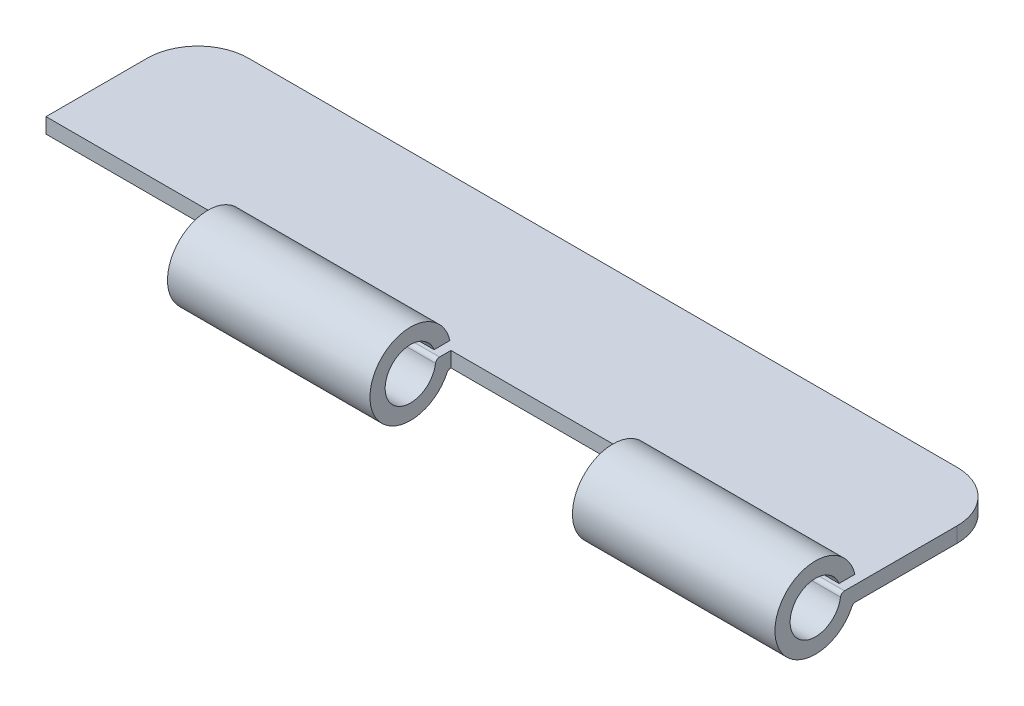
ISO-10303-21;
HEADER;
FILE_DESCRIPTION(('STEP AP214'),'2;1');
FILE_NAME('part.step','',(''),(''),'','','');
FILE_SCHEMA(('AUTOMOTIVE_DESIGN { 1 0 10303 214 1 1 1 1 }'));
ENDSEC;
DATA;
#1=APPLICATION_CONTEXT('core data for automotive mechanical design processes');
#2=APPLICATION_PROTOCOL_DEFINITION('international standard','automotive_design',2000,#1);
#3=PRODUCT_CONTEXT('',#1,'mechanical');
#4=PRODUCT('Part','Part','',(#3));
#5=PRODUCT_RELATED_PRODUCT_CATEGORY('part','',(#4));
#6=PRODUCT_DEFINITION_FORMATION('','',#4);
#7=PRODUCT_DEFINITION_CONTEXT('part definition',#1,'design');
#8=PRODUCT_DEFINITION('design','',#6,#7);
#9=PRODUCT_DEFINITION_SHAPE('','',#8);
#10=(LENGTH_UNIT() NAMED_UNIT(*) SI_UNIT(.MILLI.,.METRE.));
#11=(NAMED_UNIT(*) PLANE_ANGLE_UNIT() SI_UNIT($,.RADIAN.));
#12=(NAMED_UNIT(*) SI_UNIT($,.STERADIAN.) SOLID_ANGLE_UNIT());
#13=UNCERTAINTY_MEASURE_WITH_UNIT(LENGTH_MEASURE(1.E-05),#10,'distance_accuracy_value','');
#14=(GEOMETRIC_REPRESENTATION_CONTEXT(3) GLOBAL_UNCERTAINTY_ASSIGNED_CONTEXT((#13)) GLOBAL_UNIT_ASSIGNED_CONTEXT((#10,
#11,#12)) REPRESENTATION_CONTEXT('',''));
#15=CARTESIAN_POINT('',(0.,0.,0.));
#16=DIRECTION('',(0.,0.,1.));
#17=DIRECTION('',(1.,0.,0.));
#18=AXIS2_PLACEMENT_3D('',#15,#16,#17);
#19=CARTESIAN_POINT('',(-40.,1.5,17.5));
#20=DIRECTION('',(0.,0.,-1.));
#21=DIRECTION('',(-1.,0.,0.));
#22=AXIS2_PLACEMENT_3D('',#19,#20,#21);
#23=PLANE('',#22);
#24=DIRECTION('',(0.,1.,0.));
#25=VECTOR('',#24,1.);
#26=CARTESIAN_POINT('',(-20.,0.,17.5));
#27=LINE('',#26,#25);
#28=CARTESIAN_POINT('',(-20.,0.,17.5));
#29=VERTEX_POINT('',#28);
#30=CARTESIAN_POINT('',(-20.,1.5,17.5));
#31=VERTEX_POINT('',#30);
#32=EDGE_CURVE('E57',#29,#31,#27,.T.);
#33=ORIENTED_EDGE('',*,*,#32,.T.);
#34=DIRECTION('',(1.,0.,0.));
#35=VECTOR('',#34,1.);
#36=CARTESIAN_POINT('',(-40.,1.5,17.5));
#37=LINE('',#36,#35);
#38=CARTESIAN_POINT('',(-40.,1.5,17.5));
#39=VERTEX_POINT('',#38);
#40=EDGE_CURVE('E298',#39,#31,#37,.T.);
#41=ORIENTED_EDGE('',*,*,#40,.F.);
#42=DIRECTION('',(0.,-1.,0.));
#43=VECTOR('',#42,1.);
#44=CARTESIAN_POINT('',(-40.,1.5,17.5));
#45=LINE('',#44,#43);
#46=CARTESIAN_POINT('',(-40.,0.,17.5));
#47=VERTEX_POINT('',#46);
#48=EDGE_CURVE('E11',#39,#47,#45,.T.);
#49=ORIENTED_EDGE('',*,*,#48,.T.);
#50=DIRECTION('',(1.,0.,0.));
#51=VECTOR('',#50,1.);
#52=CARTESIAN_POINT('',(-40.,0.,17.5));
#53=LINE('',#52,#51);
#54=EDGE_CURVE('E312',#47,#29,#53,.T.);
#55=ORIENTED_EDGE('',*,*,#54,.T.);
#56=EDGE_LOOP('',(#33,#41,#49,#55));
#57=FACE_BOUND('',#56,.T.);
#58=ADVANCED_FACE('F34',(#57),#23,.F.);
#59=CARTESIAN_POINT('',(-40.,1.5,17.5));
#60=DIRECTION('',(1.,0.,0.));
#61=DIRECTION('',(0.,0.,-1.));
#62=AXIS2_PLACEMENT_3D('',#59,#60,#61);
#63=PLANE('',#62);
#64=DIRECTION('',(0.,0.,1.));
#65=VECTOR('',#64,1.);
#66=CARTESIAN_POINT('',(-40.,0.,17.5));
#67=LINE('',#66,#65);
#68=CARTESIAN_POINT('',(-40.,0.,7.50000000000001));
#69=VERTEX_POINT('',#68);
#70=EDGE_CURVE('E282',#69,#47,#67,.T.);
#71=ORIENTED_EDGE('',*,*,#70,.T.);
#72=ORIENTED_EDGE('',*,*,#48,.F.);
#73=DIRECTION('',(0.,0.,1.));
#74=VECTOR('',#73,1.);
#75=CARTESIAN_POINT('',(-40.,1.5,17.5));
#76=LINE('',#75,#74);
#77=CARTESIAN_POINT('',(-40.,1.5,7.50000000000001));
#78=VERTEX_POINT('',#77);
#79=EDGE_CURVE('E294',#78,#39,#76,.T.);
#80=ORIENTED_EDGE('',*,*,#79,.F.);
#81=DIRECTION('',(0.,-1.,0.));
#82=VECTOR('',#81,1.);
#83=CARTESIAN_POINT('',(-40.,1.5,7.50000000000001));
#84=LINE('',#83,#82);
#85=EDGE_CURVE('E308',#78,#69,#84,.T.);
#86=ORIENTED_EDGE('',*,*,#85,.T.);
#87=EDGE_LOOP('',(#71,#72,#80,#86));
#88=FACE_BOUND('',#87,.T.);
#89=ADVANCED_FACE('F36',(#88),#63,.F.);
#90=CARTESIAN_POINT('',(0.,1.5,17.5));
#91=VERTEX_POINT('',#90);
#92=CARTESIAN_POINT('',(20.,1.5,17.5));
#93=VERTEX_POINT('',#92);
#94=EDGE_CURVE('E49',#91,#93,#37,.T.);
#95=ORIENTED_EDGE('',*,*,#94,.F.);
#96=DIRECTION('',(0.,1.,0.));
#97=VECTOR('',#96,1.);
#98=CARTESIAN_POINT('',(0.,0.,17.5));
#99=LINE('',#98,#97);
#100=CARTESIAN_POINT('',(0.,0.,17.5));
#101=VERTEX_POINT('',#100);
#102=EDGE_CURVE('E219',#101,#91,#99,.T.);
#103=ORIENTED_EDGE('',*,*,#102,.F.);
#104=CARTESIAN_POINT('',(20.,0.,17.5));
#105=VERTEX_POINT('',#104);
#106=EDGE_CURVE('E311',#101,#105,#53,.T.);
#107=ORIENTED_EDGE('',*,*,#106,.T.);
#108=DIRECTION('',(0.,1.,0.));
#109=VECTOR('',#108,1.);
#110=CARTESIAN_POINT('',(20.,0.,17.5));
#111=LINE('',#110,#109);
#112=EDGE_CURVE('E249',#105,#93,#111,.T.);
#113=ORIENTED_EDGE('',*,*,#112,.T.);
#114=EDGE_LOOP('',(#95,#103,#107,#113));
#115=FACE_BOUND('',#114,.T.);
#116=ADVANCED_FACE('F376',(#115),#23,.F.);
#117=CARTESIAN_POINT('',(40.,1.5,17.5));
#118=DIRECTION('',(-1.,0.,0.));
#119=DIRECTION('',(0.,0.,1.));
#120=AXIS2_PLACEMENT_3D('',#117,#118,#119);
#121=PLANE('',#120);
#122=DIRECTION('',(0.,0.,-1.));
#123=VECTOR('',#122,1.);
#124=CARTESIAN_POINT('',(40.,0.,17.5));
#125=LINE('',#124,#123);
#126=CARTESIAN_POINT('',(40.,0.,17.5313730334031));
#127=VERTEX_POINT('',#126);
#128=CARTESIAN_POINT('',(40.,0.,7.50000000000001));
#129=VERTEX_POINT('',#128);
#130=EDGE_CURVE('E314',#127,#129,#125,.T.);
#131=ORIENTED_EDGE('',*,*,#130,.T.);
#132=DIRECTION('',(0.,-1.,0.));
#133=VECTOR('',#132,1.);
#134=CARTESIAN_POINT('',(40.,1.5,7.50000000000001));
#135=LINE('',#134,#133);
#136=CARTESIAN_POINT('',(40.,1.5,7.50000000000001));
#137=VERTEX_POINT('',#136);
#138=EDGE_CURVE('E42',#137,#129,#135,.T.);
#139=ORIENTED_EDGE('',*,*,#138,.F.);
#140=DIRECTION('',(0.,0.,-1.));
#141=VECTOR('',#140,1.);
#142=CARTESIAN_POINT('',(40.,1.5,17.5));
#143=LINE('',#142,#141);
#144=CARTESIAN_POINT('',(40.,1.5,18.627718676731));
#145=VERTEX_POINT('',#144);
#146=EDGE_CURVE('E300',#145,#137,#143,.T.);
#147=ORIENTED_EDGE('',*,*,#146,.F.);
#148=CARTESIAN_POINT('',(40.,1.1,18.627718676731));
#149=DIRECTION('',(1.,0.,0.));
#150=DIRECTION('',(0.,0.,-1.));
#151=AXIS2_PLACEMENT_3D('',#148,#149,#150);
#152=CIRCLE('',#151,0.399999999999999);
#153=CARTESIAN_POINT('',(40.,1.1551724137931,19.023895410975));
#154=VERTEX_POINT('',#153);
#155=EDGE_CURVE('E269',#145,#154,#152,.T.);
#156=ORIENTED_EDGE('',*,*,#155,.T.);
#157=CARTESIAN_POINT('',(40.,1.5,21.5));
#158=DIRECTION('',(-1.,0.,0.));
#159=DIRECTION('',(0.,0.,-1.));
#160=AXIS2_PLACEMENT_3D('',#157,#158,#159);
#161=CIRCLE('',#160,2.5);
#162=CARTESIAN_POINT('',(40.,2.39676420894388,19.1663732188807));
#163=VERTEX_POINT('',#162);
#164=EDGE_CURVE('E272',#154,#163,#161,.T.);
#165=ORIENTED_EDGE('',*,*,#164,.T.);
#166=DIRECTION('',(0.,0.,-1.));
#167=VECTOR('',#166,1.);
#168=CARTESIAN_POINT('',(40.,2.39676420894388,17.6018191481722));
#169=LINE('',#168,#167);
#170=CARTESIAN_POINT('',(40.,2.39676420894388,17.6018191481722));
#171=VERTEX_POINT('',#170);
#172=EDGE_CURVE('E275',#163,#171,#169,.T.);
#173=ORIENTED_EDGE('',*,*,#172,.T.);
#174=CARTESIAN_POINT('',(40.,1.5,21.5));
#175=DIRECTION('',(1.,0.,0.));
#176=DIRECTION('',(0.,0.,-1.));
#177=AXIS2_PLACEMENT_3D('',#174,#175,#176);
#178=CIRCLE('',#177,4.);
#179=CARTESIAN_POINT('',(40.,-0.227272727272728,17.8921573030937));
#180=VERTEX_POINT('',#179);
#181=EDGE_CURVE('E246',#171,#180,#178,.T.);
#182=ORIENTED_EDGE('',*,*,#181,.T.);
#183=CARTESIAN_POINT('',(40.,-0.4,17.5313730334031));
#184=DIRECTION('',(-1.,0.,0.));
#185=DIRECTION('',(0.,0.,-1.));
#186=AXIS2_PLACEMENT_3D('',#183,#184,#185);
#187=CIRCLE('',#186,0.4);
#188=EDGE_CURVE('E234',#180,#127,#187,.T.);
#189=ORIENTED_EDGE('',*,*,#188,.T.);
#190=EDGE_LOOP('',(#131,#139,#147,#156,#165,#173,#182,#189));
#191=FACE_BOUND('',#190,.T.);
#192=ADVANCED_FACE('F351',(#191),#121,.F.);
#193=CARTESIAN_POINT('',(35.,1.5,7.50000000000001));
#194=DIRECTION('',(0.,-1.,0.));
#195=DIRECTION('',(0.,0.,-1.));
#196=AXIS2_PLACEMENT_3D('',#193,#194,#195);
#197=CYLINDRICAL_SURFACE('',#196,5.);
#198=CARTESIAN_POINT('',(35.,0.,7.50000000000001));
#199=DIRECTION('',(0.,1.,0.));
#200=DIRECTION('',(0.,0.,-1.));
#201=AXIS2_PLACEMENT_3D('',#198,#199,#200);
#202=CIRCLE('',#201,5.);
#203=CARTESIAN_POINT('',(35.,0.,2.50000000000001));
#204=VERTEX_POINT('',#203);
#205=EDGE_CURVE('E316',#129,#204,#202,.T.);
#206=ORIENTED_EDGE('',*,*,#205,.T.);
#207=DIRECTION('',(0.,-1.,0.));
#208=VECTOR('',#207,1.);
#209=CARTESIAN_POINT('',(35.,1.5,2.50000000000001));
#210=LINE('',#209,#208);
#211=CARTESIAN_POINT('',(35.,1.5,2.50000000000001));
#212=VERTEX_POINT('',#211);
#213=EDGE_CURVE('E326',#212,#204,#210,.T.);
#214=ORIENTED_EDGE('',*,*,#213,.F.);
#215=CARTESIAN_POINT('',(35.,1.5,7.50000000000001));
#216=DIRECTION('',(0.,1.,0.));
#217=DIRECTION('',(0.,0.,-1.));
#218=AXIS2_PLACEMENT_3D('',#215,#216,#217);
#219=CIRCLE('',#218,5.);
#220=EDGE_CURVE('E302',#137,#212,#219,.T.);
#221=ORIENTED_EDGE('',*,*,#220,.F.);
#222=ORIENTED_EDGE('',*,*,#138,.T.);
#223=EDGE_LOOP('',(#206,#214,#221,#222));
#224=FACE_BOUND('',#223,.T.);
#225=ADVANCED_FACE('F333',(#224),#197,.T.);
#226=CARTESIAN_POINT('',(-35.,1.5,2.5));
#227=DIRECTION('',(0.,0.,1.));
#228=DIRECTION('',(1.,0.,0.));
#229=AXIS2_PLACEMENT_3D('',#226,#227,#228);
#230=PLANE('',#229);
#231=DIRECTION('',(-1.,0.,0.));
#232=VECTOR('',#231,1.);
#233=CARTESIAN_POINT('',(-35.,0.,2.5));
#234=LINE('',#233,#232);
#235=CARTESIAN_POINT('',(-35.,0.,2.5));
#236=VERTEX_POINT('',#235);
#237=EDGE_CURVE('E318',#204,#236,#234,.T.);
#238=ORIENTED_EDGE('',*,*,#237,.T.);
#239=DIRECTION('',(0.,-1.,0.));
#240=VECTOR('',#239,1.);
#241=CARTESIAN_POINT('',(-35.,1.5,2.5));
#242=LINE('',#241,#240);
#243=CARTESIAN_POINT('',(-35.,1.5,2.5));
#244=VERTEX_POINT('',#243);
#245=EDGE_CURVE('E323',#244,#236,#242,.T.);
#246=ORIENTED_EDGE('',*,*,#245,.F.);
#247=DIRECTION('',(-1.,0.,0.));
#248=VECTOR('',#247,1.);
#249=CARTESIAN_POINT('',(-35.,1.5,2.5));
#250=LINE('',#249,#248);
#251=EDGE_CURVE('E304',#212,#244,#250,.T.);
#252=ORIENTED_EDGE('',*,*,#251,.F.);
#253=ORIENTED_EDGE('',*,*,#213,.T.);
#254=EDGE_LOOP('',(#238,#246,#252,#253));
#255=FACE_BOUND('',#254,.T.);
#256=ADVANCED_FACE('F340',(#255),#230,.F.);
#257=CARTESIAN_POINT('',(-35.,1.5,7.50000000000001));
#258=DIRECTION('',(0.,-1.,0.));
#259=DIRECTION('',(0.,0.,-1.));
#260=AXIS2_PLACEMENT_3D('',#257,#258,#259);
#261=CYLINDRICAL_SURFACE('',#260,5.);
#262=CARTESIAN_POINT('',(-35.,0.,7.50000000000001));
#263=DIRECTION('',(0.,1.,0.));
#264=DIRECTION('',(0.,0.,-1.));
#265=AXIS2_PLACEMENT_3D('',#262,#263,#264);
#266=CIRCLE('',#265,5.);
#267=EDGE_CURVE('E297',#236,#69,#266,.T.);
#268=ORIENTED_EDGE('',*,*,#267,.T.);
#269=ORIENTED_EDGE('',*,*,#85,.F.);
#270=CARTESIAN_POINT('',(-35.,1.5,7.50000000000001));
#271=DIRECTION('',(0.,1.,0.));
#272=DIRECTION('',(0.,0.,-1.));
#273=AXIS2_PLACEMENT_3D('',#270,#271,#272);
#274=CIRCLE('',#273,5.);
#275=EDGE_CURVE('E306',#244,#78,#274,.T.);
#276=ORIENTED_EDGE('',*,*,#275,.F.);
#277=ORIENTED_EDGE('',*,*,#245,.T.);
#278=EDGE_LOOP('',(#268,#269,#276,#277));
#279=FACE_BOUND('',#278,.T.);
#280=ADVANCED_FACE('F344',(#279),#261,.T.);
#281=CARTESIAN_POINT('',(-35.,1.5,7.50000000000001));
#282=DIRECTION('',(0.,-1.,0.));
#283=DIRECTION('',(0.,0.,-1.));
#284=AXIS2_PLACEMENT_3D('',#281,#282,#283);
#285=PLANE('',#284);
#286=ORIENTED_EDGE('',*,*,#79,.T.);
#287=ORIENTED_EDGE('',*,*,#40,.T.);
#288=DIRECTION('',(0.,0.,1.));
#289=VECTOR('',#288,1.);
#290=CARTESIAN_POINT('',(-20.,1.5,17.5));
#291=LINE('',#290,#289);
#292=CARTESIAN_POINT('',(-20.,1.5,18.627718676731));
#293=VERTEX_POINT('',#292);
#294=EDGE_CURVE('E203',#31,#293,#291,.T.);
#295=ORIENTED_EDGE('',*,*,#294,.T.);
#296=DIRECTION('',(1.,0.,0.));
#297=VECTOR('',#296,1.);
#298=CARTESIAN_POINT('',(-20.,1.5,18.627718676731));
#299=LINE('',#298,#297);
#300=CARTESIAN_POINT('',(0.,1.5,18.627718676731));
#301=VERTEX_POINT('',#300);
#302=EDGE_CURVE('E183',#293,#301,#299,.T.);
#303=ORIENTED_EDGE('',*,*,#302,.T.);
#304=DIRECTION('',(0.,0.,1.));
#305=VECTOR('',#304,1.);
#306=CARTESIAN_POINT('',(0.,1.5,17.5));
#307=LINE('',#306,#305);
#308=EDGE_CURVE('E222',#91,#301,#307,.T.);
#309=ORIENTED_EDGE('',*,*,#308,.F.);
#310=ORIENTED_EDGE('',*,*,#94,.T.);
#311=DIRECTION('',(0.,0.,1.));
#312=VECTOR('',#311,1.);
#313=CARTESIAN_POINT('',(20.,1.5,17.5));
#314=LINE('',#313,#312);
#315=CARTESIAN_POINT('',(20.,1.5,18.627718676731));
#316=VERTEX_POINT('',#315);
#317=EDGE_CURVE('E251',#93,#316,#314,.T.);
#318=ORIENTED_EDGE('',*,*,#317,.T.);
#319=DIRECTION('',(1.,0.,0.));
#320=VECTOR('',#319,1.);
#321=CARTESIAN_POINT('',(20.,1.5,18.627718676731));
#322=LINE('',#321,#320);
#323=EDGE_CURVE('E289',#316,#145,#322,.T.);
#324=ORIENTED_EDGE('',*,*,#323,.T.);
#325=ORIENTED_EDGE('',*,*,#146,.T.);
#326=ORIENTED_EDGE('',*,*,#220,.T.);
#327=ORIENTED_EDGE('',*,*,#251,.T.);
#328=ORIENTED_EDGE('',*,*,#275,.T.);
#329=EDGE_LOOP('',(#286,#287,#295,#303,#309,#310,#318,#324,#325,#326,#327,#328));
#330=FACE_BOUND('',#329,.T.);
#331=ADVANCED_FACE('F348',(#330),#285,.F.);
#332=CARTESIAN_POINT('',(-35.,0.,7.50000000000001));
#333=DIRECTION('',(0.,-1.,0.));
#334=DIRECTION('',(0.,0.,-1.));
#335=AXIS2_PLACEMENT_3D('',#332,#333,#334);
#336=PLANE('',#335);
#337=ORIENTED_EDGE('',*,*,#70,.F.);
#338=ORIENTED_EDGE('',*,*,#267,.F.);
#339=ORIENTED_EDGE('',*,*,#237,.F.);
#340=ORIENTED_EDGE('',*,*,#205,.F.);
#341=ORIENTED_EDGE('',*,*,#130,.F.);
#342=DIRECTION('',(1.,0.,0.));
#343=VECTOR('',#342,1.);
#344=CARTESIAN_POINT('',(20.,0.,17.5313730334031));
#345=LINE('',#344,#343);
#346=CARTESIAN_POINT('',(20.,0.,17.5313730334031));
#347=VERTEX_POINT('',#346);
#348=EDGE_CURVE('E266',#347,#127,#345,.T.);
#349=ORIENTED_EDGE('',*,*,#348,.F.);
#350=DIRECTION('',(0.,0.,-1.));
#351=VECTOR('',#350,1.);
#352=CARTESIAN_POINT('',(20.,0.,17.5313730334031));
#353=LINE('',#352,#351);
#354=EDGE_CURVE('E245',#347,#105,#353,.T.);
#355=ORIENTED_EDGE('',*,*,#354,.T.);
#356=ORIENTED_EDGE('',*,*,#106,.F.);
#357=DIRECTION('',(0.,0.,-1.));
#358=VECTOR('',#357,1.);
#359=CARTESIAN_POINT('',(0.,0.,17.5313730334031));
#360=LINE('',#359,#358);
#361=CARTESIAN_POINT('',(0.,0.,17.5313730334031));
#362=VERTEX_POINT('',#361);
#363=EDGE_CURVE('E178',#362,#101,#360,.T.);
#364=ORIENTED_EDGE('',*,*,#363,.F.);
#365=DIRECTION('',(1.,0.,0.));
#366=VECTOR('',#365,1.);
#367=CARTESIAN_POINT('',(-20.,0.,17.5313730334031));
#368=LINE('',#367,#366);
#369=CARTESIAN_POINT('',(-20.,0.,17.5313730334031));
#370=VERTEX_POINT('',#369);
#371=EDGE_CURVE('E172',#370,#362,#368,.T.);
#372=ORIENTED_EDGE('',*,*,#371,.F.);
#373=DIRECTION('',(0.,0.,-1.));
#374=VECTOR('',#373,1.);
#375=CARTESIAN_POINT('',(-20.,0.,17.5313730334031));
#376=LINE('',#375,#374);
#377=EDGE_CURVE('E176',#370,#29,#376,.T.);
#378=ORIENTED_EDGE('',*,*,#377,.T.);
#379=ORIENTED_EDGE('',*,*,#54,.F.);
#380=EDGE_LOOP('',(#337,#338,#339,#340,#341,#349,#355,#356,#364,#372,#378,#379));
#381=FACE_BOUND('',#380,.T.);
#382=ADVANCED_FACE('F175',(#381),#336,.T.);
#383=CARTESIAN_POINT('',(20.,-0.4,17.5313730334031));
#384=DIRECTION('',(1.,0.,0.));
#385=DIRECTION('',(0.,0.,-1.));
#386=AXIS2_PLACEMENT_3D('',#383,#384,#385);
#387=CYLINDRICAL_SURFACE('',#386,0.4);
#388=ORIENTED_EDGE('',*,*,#188,.F.);
#389=DIRECTION('',(1.,0.,0.));
#390=VECTOR('',#389,1.);
#391=CARTESIAN_POINT('',(20.,-0.227272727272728,17.8921573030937));
#392=LINE('',#391,#390);
#393=CARTESIAN_POINT('',(20.,-0.227272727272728,17.8921573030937));
#394=VERTEX_POINT('',#393);
#395=EDGE_CURVE('E280',#394,#180,#392,.T.);
#396=ORIENTED_EDGE('',*,*,#395,.F.);
#397=CARTESIAN_POINT('',(20.,-0.4,17.5313730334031));
#398=DIRECTION('',(-1.,0.,0.));
#399=DIRECTION('',(0.,0.,-1.));
#400=AXIS2_PLACEMENT_3D('',#397,#398,#399);
#401=CIRCLE('',#400,0.4);
#402=EDGE_CURVE('E242',#394,#347,#401,.T.);
#403=ORIENTED_EDGE('',*,*,#402,.T.);
#404=ORIENTED_EDGE('',*,*,#348,.T.);
#405=EDGE_LOOP('',(#388,#396,#403,#404));
#406=FACE_BOUND('',#405,.T.);
#407=ADVANCED_FACE('F370',(#406),#387,.F.);
#408=CARTESIAN_POINT('',(20.,1.5,21.5));
#409=DIRECTION('',(1.,0.,0.));
#410=DIRECTION('',(0.,0.,-1.));
#411=AXIS2_PLACEMENT_3D('',#408,#409,#410);
#412=CYLINDRICAL_SURFACE('',#411,4.);
#413=ORIENTED_EDGE('',*,*,#181,.F.);
#414=DIRECTION('',(1.,0.,0.));
#415=VECTOR('',#414,1.);
#416=CARTESIAN_POINT('',(20.,2.39676420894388,17.6018191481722));
#417=LINE('',#416,#415);
#418=CARTESIAN_POINT('',(20.,2.39676420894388,17.6018191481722));
#419=VERTEX_POINT('',#418);
#420=EDGE_CURVE('E283',#419,#171,#417,.T.);
#421=ORIENTED_EDGE('',*,*,#420,.F.);
#422=CARTESIAN_POINT('',(20.,1.5,21.5));
#423=DIRECTION('',(1.,0.,0.));
#424=DIRECTION('',(0.,0.,-1.));
#425=AXIS2_PLACEMENT_3D('',#422,#423,#424);
#426=CIRCLE('',#425,4.);
#427=EDGE_CURVE('E263',#419,#394,#426,.T.);
#428=ORIENTED_EDGE('',*,*,#427,.T.);
#429=ORIENTED_EDGE('',*,*,#395,.T.);
#430=EDGE_LOOP('',(#413,#421,#428,#429));
#431=FACE_BOUND('',#430,.T.);
#432=ADVANCED_FACE('F365',(#431),#412,.T.);
#433=CARTESIAN_POINT('',(20.,2.39676420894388,17.6018191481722));
#434=DIRECTION('',(0.,-1.,0.));
#435=DIRECTION('',(0.,0.,-1.));
#436=AXIS2_PLACEMENT_3D('',#433,#434,#435);
#437=PLANE('',#436);
#438=ORIENTED_EDGE('',*,*,#172,.F.);
#439=DIRECTION('',(1.,0.,0.));
#440=VECTOR('',#439,1.);
#441=CARTESIAN_POINT('',(20.,2.39676420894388,19.1663732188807));
#442=LINE('',#441,#440);
#443=CARTESIAN_POINT('',(20.,2.39676420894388,19.1663732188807));
#444=VERTEX_POINT('',#443);
#445=EDGE_CURVE('E285',#444,#163,#442,.T.);
#446=ORIENTED_EDGE('',*,*,#445,.F.);
#447=DIRECTION('',(0.,0.,-1.));
#448=VECTOR('',#447,1.);
#449=CARTESIAN_POINT('',(20.,2.39676420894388,17.6018191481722));
#450=LINE('',#449,#448);
#451=EDGE_CURVE('E260',#444,#419,#450,.T.);
#452=ORIENTED_EDGE('',*,*,#451,.T.);
#453=ORIENTED_EDGE('',*,*,#420,.T.);
#454=EDGE_LOOP('',(#438,#446,#452,#453));
#455=FACE_BOUND('',#454,.T.);
#456=ADVANCED_FACE('F362',(#455),#437,.T.);
#457=CARTESIAN_POINT('',(20.,1.5,21.5));
#458=DIRECTION('',(1.,0.,0.));
#459=DIRECTION('',(0.,0.,-1.));
#460=AXIS2_PLACEMENT_3D('',#457,#458,#459);
#461=CYLINDRICAL_SURFACE('',#460,2.5);
#462=ORIENTED_EDGE('',*,*,#164,.F.);
#463=DIRECTION('',(1.,0.,0.));
#464=VECTOR('',#463,1.);
#465=CARTESIAN_POINT('',(20.,1.1551724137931,19.023895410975));
#466=LINE('',#465,#464);
#467=CARTESIAN_POINT('',(20.,1.1551724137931,19.023895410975));
#468=VERTEX_POINT('',#467);
#469=EDGE_CURVE('E287',#468,#154,#466,.T.);
#470=ORIENTED_EDGE('',*,*,#469,.F.);
#471=CARTESIAN_POINT('',(20.,1.5,21.5));
#472=DIRECTION('',(-1.,0.,0.));
#473=DIRECTION('',(0.,0.,-1.));
#474=AXIS2_PLACEMENT_3D('',#471,#472,#473);
#475=CIRCLE('',#474,2.5);
#476=EDGE_CURVE('E257',#468,#444,#475,.T.);
#477=ORIENTED_EDGE('',*,*,#476,.T.);
#478=ORIENTED_EDGE('',*,*,#445,.T.);
#479=EDGE_LOOP('',(#462,#470,#477,#478));
#480=FACE_BOUND('',#479,.T.);
#481=ADVANCED_FACE('F358',(#480),#461,.F.);
#482=CARTESIAN_POINT('',(20.,1.1,18.627718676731));
#483=DIRECTION('',(1.,0.,0.));
#484=DIRECTION('',(0.,0.,-1.));
#485=AXIS2_PLACEMENT_3D('',#482,#483,#484);
#486=CYLINDRICAL_SURFACE('',#485,0.399999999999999);
#487=ORIENTED_EDGE('',*,*,#155,.F.);
#488=ORIENTED_EDGE('',*,*,#323,.F.);
#489=CARTESIAN_POINT('',(20.,1.1,18.627718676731));
#490=DIRECTION('',(1.,0.,0.));
#491=DIRECTION('',(0.,0.,-1.));
#492=AXIS2_PLACEMENT_3D('',#489,#490,#491);
#493=CIRCLE('',#492,0.399999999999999);
#494=EDGE_CURVE('E254',#316,#468,#493,.T.);
#495=ORIENTED_EDGE('',*,*,#494,.T.);
#496=ORIENTED_EDGE('',*,*,#469,.T.);
#497=EDGE_LOOP('',(#487,#488,#495,#496));
#498=FACE_BOUND('',#497,.T.);
#499=ADVANCED_FACE('F354',(#498),#486,.T.);
#500=CARTESIAN_POINT('',(20.,-0.4,17.5313730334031));
#501=DIRECTION('',(1.,0.,0.));
#502=DIRECTION('',(0.,0.,-1.));
#503=AXIS2_PLACEMENT_3D('',#500,#501,#502);
#504=PLANE('',#503);
#505=ORIENTED_EDGE('',*,*,#402,.F.);
#506=ORIENTED_EDGE('',*,*,#427,.F.);
#507=ORIENTED_EDGE('',*,*,#451,.F.);
#508=ORIENTED_EDGE('',*,*,#476,.F.);
#509=ORIENTED_EDGE('',*,*,#494,.F.);
#510=ORIENTED_EDGE('',*,*,#317,.F.);
#511=ORIENTED_EDGE('',*,*,#112,.F.);
#512=ORIENTED_EDGE('',*,*,#354,.F.);
#513=EDGE_LOOP('',(#505,#506,#507,#508,#509,#510,#511,#512));
#514=FACE_BOUND('',#513,.T.);
#515=ADVANCED_FACE('F374',(#514),#504,.F.);
#516=CARTESIAN_POINT('',(-20.,-0.4,17.5313730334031));
#517=DIRECTION('',(1.,0.,0.));
#518=DIRECTION('',(0.,0.,-1.));
#519=AXIS2_PLACEMENT_3D('',#516,#517,#518);
#520=CYLINDRICAL_SURFACE('',#519,0.4);
#521=CARTESIAN_POINT('',(0.,-0.4,17.5313730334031));
#522=DIRECTION('',(-1.,0.,0.));
#523=DIRECTION('',(0.,0.,-1.));
#524=AXIS2_PLACEMENT_3D('',#521,#522,#523);
#525=CIRCLE('',#524,0.4);
#526=CARTESIAN_POINT('',(0.,-0.227272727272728,17.8921573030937));
#527=VERTEX_POINT('',#526);
#528=EDGE_CURVE('E216',#527,#362,#525,.T.);
#529=ORIENTED_EDGE('',*,*,#528,.F.);
#530=DIRECTION('',(1.,0.,0.));
#531=VECTOR('',#530,1.);
#532=CARTESIAN_POINT('',(-20.,-0.227272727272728,17.8921573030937));
#533=LINE('',#532,#531);
#534=CARTESIAN_POINT('',(-20.,-0.227272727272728,17.8921573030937));
#535=VERTEX_POINT('',#534);
#536=EDGE_CURVE('E195',#535,#527,#533,.T.);
#537=ORIENTED_EDGE('',*,*,#536,.F.);
#538=CARTESIAN_POINT('',(-20.,-0.4,17.5313730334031));
#539=DIRECTION('',(-1.,0.,0.));
#540=DIRECTION('',(0.,0.,-1.));
#541=AXIS2_PLACEMENT_3D('',#538,#539,#540);
#542=CIRCLE('',#541,0.4);
#543=EDGE_CURVE('E190',#535,#370,#542,.T.);
#544=ORIENTED_EDGE('',*,*,#543,.T.);
#545=ORIENTED_EDGE('',*,*,#371,.T.);
#546=EDGE_LOOP('',(#529,#537,#544,#545));
#547=FACE_BOUND('',#546,.T.);
#548=ADVANCED_FACE('F194',(#547),#520,.F.);
#549=CARTESIAN_POINT('',(-20.,1.5,21.5));
#550=DIRECTION('',(1.,0.,0.));
#551=DIRECTION('',(0.,0.,-1.));
#552=AXIS2_PLACEMENT_3D('',#549,#550,#551);
#553=CYLINDRICAL_SURFACE('',#552,4.);
#554=CARTESIAN_POINT('',(0.,1.5,21.5));
#555=DIRECTION('',(1.,0.,0.));
#556=DIRECTION('',(0.,0.,-1.));
#557=AXIS2_PLACEMENT_3D('',#554,#555,#556);
#558=CIRCLE('',#557,4.);
#559=CARTESIAN_POINT('',(0.,2.39676420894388,17.6018191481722));
#560=VERTEX_POINT('',#559);
#561=EDGE_CURVE('E196',#560,#527,#558,.T.);
#562=ORIENTED_EDGE('',*,*,#561,.F.);
#563=DIRECTION('',(1.,0.,0.));
#564=VECTOR('',#563,1.);
#565=CARTESIAN_POINT('',(-20.,2.39676420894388,17.6018191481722));
#566=LINE('',#565,#564);
#567=CARTESIAN_POINT('',(-20.,2.39676420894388,17.6018191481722));
#568=VERTEX_POINT('',#567);
#569=EDGE_CURVE('E235',#568,#560,#566,.T.);
#570=ORIENTED_EDGE('',*,*,#569,.F.);
#571=CARTESIAN_POINT('',(-20.,1.5,21.5));
#572=DIRECTION('',(1.,0.,0.));
#573=DIRECTION('',(0.,0.,-1.));
#574=AXIS2_PLACEMENT_3D('',#571,#572,#573);
#575=CIRCLE('',#574,4.);
#576=EDGE_CURVE('E184',#568,#535,#575,.T.);
#577=ORIENTED_EDGE('',*,*,#576,.T.);
#578=ORIENTED_EDGE('',*,*,#536,.T.);
#579=EDGE_LOOP('',(#562,#570,#577,#578));
#580=FACE_BOUND('',#579,.T.);
#581=ADVANCED_FACE('F382',(#580),#553,.T.);
#582=CARTESIAN_POINT('',(-20.,2.39676420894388,17.6018191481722));
#583=DIRECTION('',(0.,-1.,0.));
#584=DIRECTION('',(0.,0.,-1.));
#585=AXIS2_PLACEMENT_3D('',#582,#583,#584);
#586=PLANE('',#585);
#587=DIRECTION('',(0.,0.,-1.));
#588=VECTOR('',#587,1.);
#589=CARTESIAN_POINT('',(0.,2.39676420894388,17.6018191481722));
#590=LINE('',#589,#588);
#591=CARTESIAN_POINT('',(0.,2.39676420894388,19.1663732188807));
#592=VERTEX_POINT('',#591);
#593=EDGE_CURVE('E199',#592,#560,#590,.T.);
#594=ORIENTED_EDGE('',*,*,#593,.F.);
#595=DIRECTION('',(1.,0.,0.));
#596=VECTOR('',#595,1.);
#597=CARTESIAN_POINT('',(-20.,2.39676420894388,19.1663732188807));
#598=LINE('',#597,#596);
#599=CARTESIAN_POINT('',(-20.,2.39676420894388,19.1663732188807));
#600=VERTEX_POINT('',#599);
#601=EDGE_CURVE('E237',#600,#592,#598,.T.);
#602=ORIENTED_EDGE('',*,*,#601,.F.);
#603=DIRECTION('',(0.,0.,-1.));
#604=VECTOR('',#603,1.);
#605=CARTESIAN_POINT('',(-20.,2.39676420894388,17.6018191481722));
#606=LINE('',#605,#604);
#607=EDGE_CURVE('E212',#600,#568,#606,.T.);
#608=ORIENTED_EDGE('',*,*,#607,.T.);
#609=ORIENTED_EDGE('',*,*,#569,.T.);
#610=EDGE_LOOP('',(#594,#602,#608,#609));
#611=FACE_BOUND('',#610,.T.);
#612=ADVANCED_FACE('F432',(#611),#586,.T.);
#613=CARTESIAN_POINT('',(-20.,1.5,21.5));
#614=DIRECTION('',(1.,0.,0.));
#615=DIRECTION('',(0.,0.,-1.));
#616=AXIS2_PLACEMENT_3D('',#613,#614,#615);
#617=CYLINDRICAL_SURFACE('',#616,2.5);
#618=CARTESIAN_POINT('',(0.,1.5,21.5));
#619=DIRECTION('',(-1.,0.,0.));
#620=DIRECTION('',(0.,0.,-1.));
#621=AXIS2_PLACEMENT_3D('',#618,#619,#620);
#622=CIRCLE('',#621,2.5);
#623=CARTESIAN_POINT('',(0.,1.1551724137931,19.023895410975));
#624=VERTEX_POINT('',#623);
#625=EDGE_CURVE('E228',#624,#592,#622,.T.);
#626=ORIENTED_EDGE('',*,*,#625,.F.);
#627=DIRECTION('',(1.,0.,0.));
#628=VECTOR('',#627,1.);
#629=CARTESIAN_POINT('',(-20.,1.1551724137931,19.023895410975));
#630=LINE('',#629,#628);
#631=CARTESIAN_POINT('',(-20.,1.1551724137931,19.023895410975));
#632=VERTEX_POINT('',#631);
#633=EDGE_CURVE('E239',#632,#624,#630,.T.);
#634=ORIENTED_EDGE('',*,*,#633,.F.);
#635=CARTESIAN_POINT('',(-20.,1.5,21.5));
#636=DIRECTION('',(-1.,0.,0.));
#637=DIRECTION('',(0.,0.,-1.));
#638=AXIS2_PLACEMENT_3D('',#635,#636,#637);
#639=CIRCLE('',#638,2.5);
#640=EDGE_CURVE('E209',#632,#600,#639,.T.);
#641=ORIENTED_EDGE('',*,*,#640,.T.);
#642=ORIENTED_EDGE('',*,*,#601,.T.);
#643=EDGE_LOOP('',(#626,#634,#641,#642));
#644=FACE_BOUND('',#643,.T.);
#645=ADVANCED_FACE('F389',(#644),#617,.F.);
#646=CARTESIAN_POINT('',(-20.,1.1,18.627718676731));
#647=DIRECTION('',(1.,0.,0.));
#648=DIRECTION('',(0.,0.,-1.));
#649=AXIS2_PLACEMENT_3D('',#646,#647,#648);
#650=CYLINDRICAL_SURFACE('',#649,0.399999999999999);
#651=CARTESIAN_POINT('',(0.,1.1,18.627718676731));
#652=DIRECTION('',(1.,0.,0.));
#653=DIRECTION('',(0.,0.,-1.));
#654=AXIS2_PLACEMENT_3D('',#651,#652,#653);
#655=CIRCLE('',#654,0.399999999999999);
#656=EDGE_CURVE('E225',#301,#624,#655,.T.);
#657=ORIENTED_EDGE('',*,*,#656,.F.);
#658=ORIENTED_EDGE('',*,*,#302,.F.);
#659=CARTESIAN_POINT('',(-20.,1.1,18.627718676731));
#660=DIRECTION('',(1.,0.,0.));
#661=DIRECTION('',(0.,0.,-1.));
#662=AXIS2_PLACEMENT_3D('',#659,#660,#661);
#663=CIRCLE('',#662,0.399999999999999);
#664=EDGE_CURVE('E206',#293,#632,#663,.T.);
#665=ORIENTED_EDGE('',*,*,#664,.T.);
#666=ORIENTED_EDGE('',*,*,#633,.T.);
#667=EDGE_LOOP('',(#657,#658,#665,#666));
#668=FACE_BOUND('',#667,.T.);
#669=ADVANCED_FACE('F392',(#668),#650,.T.);
#670=CARTESIAN_POINT('',(-20.,-0.4,17.5313730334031));
#671=DIRECTION('',(1.,0.,0.));
#672=DIRECTION('',(0.,0.,-1.));
#673=AXIS2_PLACEMENT_3D('',#670,#671,#672);
#674=PLANE('',#673);
#675=ORIENTED_EDGE('',*,*,#543,.F.);
#676=ORIENTED_EDGE('',*,*,#576,.F.);
#677=ORIENTED_EDGE('',*,*,#607,.F.);
#678=ORIENTED_EDGE('',*,*,#640,.F.);
#679=ORIENTED_EDGE('',*,*,#664,.F.);
#680=ORIENTED_EDGE('',*,*,#294,.F.);
#681=ORIENTED_EDGE('',*,*,#32,.F.);
#682=ORIENTED_EDGE('',*,*,#377,.F.);
#683=EDGE_LOOP('',(#675,#676,#677,#678,#679,#680,#681,#682));
#684=FACE_BOUND('',#683,.T.);
#685=ADVANCED_FACE('F188',(#684),#674,.F.);
#686=CARTESIAN_POINT('',(0.,-0.4,17.5313730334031));
#687=DIRECTION('',(1.,0.,0.));
#688=DIRECTION('',(0.,0.,-1.));
#689=AXIS2_PLACEMENT_3D('',#686,#687,#688);
#690=PLANE('',#689);
#691=ORIENTED_EDGE('',*,*,#528,.T.);
#692=ORIENTED_EDGE('',*,*,#363,.T.);
#693=ORIENTED_EDGE('',*,*,#102,.T.);
#694=ORIENTED_EDGE('',*,*,#308,.T.);
#695=ORIENTED_EDGE('',*,*,#656,.T.);
#696=ORIENTED_EDGE('',*,*,#625,.T.);
#697=ORIENTED_EDGE('',*,*,#593,.T.);
#698=ORIENTED_EDGE('',*,*,#561,.T.);
#699=EDGE_LOOP('',(#691,#692,#693,#694,#695,#696,#697,#698));
#700=FACE_BOUND('',#699,.T.);
#701=ADVANCED_FACE('F378',(#700),#690,.T.);
#702=CLOSED_SHELL('',(#58,#89,#116,#192,#225,#256,#280,#331,#382,#407,#432,#456,#481,#499,#515,
#548,#581,#612,#645,#669,#685,#701));
#703=MANIFOLD_SOLID_BREP('B2',#702);
#704=ADVANCED_BREP_SHAPE_REPRESENTATION('',(#18,#703),#14);
#705=SHAPE_DEFINITION_REPRESENTATION(#9,#704);
ENDSEC;
END-ISO-10303-21;
